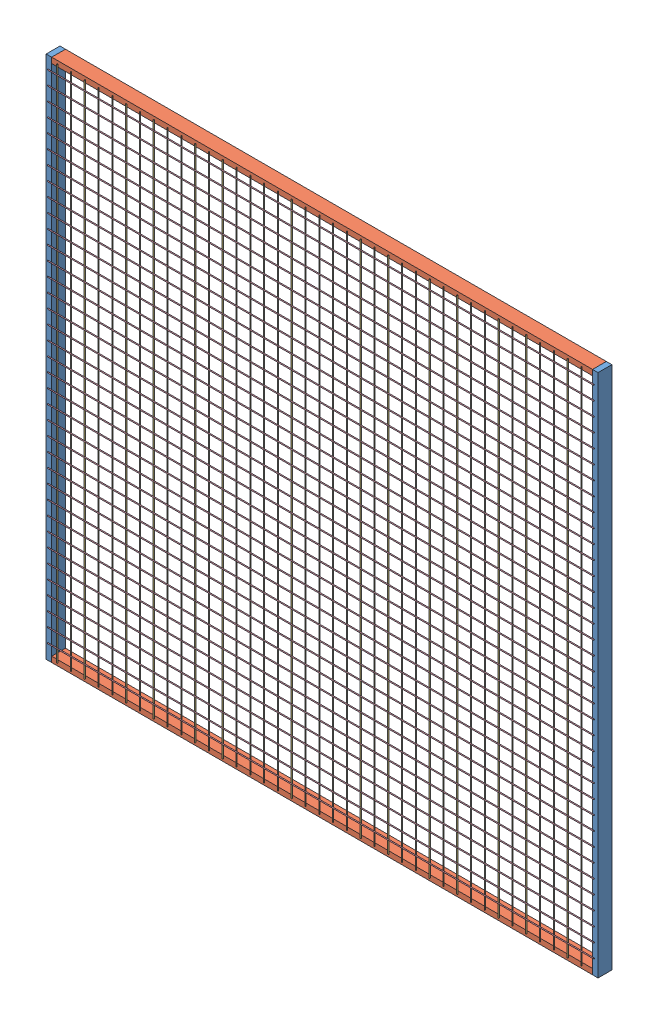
SolidWorks assembly 14E050 grille protection 1960x1900.SLDASM, configuration Défaut (file format 10000). Lengths in mm.
Overall size (2000 1900 56.43).
80 component instances, 4 part files, 16 mates.
Components (placement in the parent):
- 14E026 profilé grillage 1900x50x20-1: 14E026 profilé grillage 1900x50x20.SLDPRT [Défaut] at (-693.1899 -954.8799 25) size (20 1900 50)
- 14E026 profilé grillage 1900x50x20-2: 14E026 profilé grillage 1900x50x20.SLDPRT [Défaut] at (1286.8101 -954.8799 25) size (20 1900 50)
- 14E025 profilé grillage 1960x50x20-1: 14E025 profilé grillage 1960x50x20.SLDPRT [Défaut] at (1286.8101 925.1201 25) x (0 1 0) z (0 0 1) size (20 1960 50)
- 14E025 profilé grillage 1960x50x20-2: 14E025 profilé grillage 1960x50x20.SLDPRT [Défaut] at (1286.8101 -954.8799 25) x (0 1 0) z (0 0 1) size (20 1960 50)
- 14E031 fils vertical grille 1860 diam 3-147: 14E031 fils vertical grille 1860 diam 3.SLDPRT [Défaut] at (-651.6899 -944.8799 26.5) x (-0.245087 0 -0.969501) z (0.969501 0 -0.245087) size (3 1880 3)
- 14E031 fils vertical grille 1860 diam 3-148: 14E031 fils vertical grille 1860 diam 3.SLDPRT [Défaut] at (-601.6899 -944.8799 26.5) x (-0.245087 0 -0.969501) z (0.969501 0 -0.245087) size (3 1880 3)
- 14E031 fils vertical grille 1860 diam 3-149: 14E031 fils vertical grille 1860 diam 3.SLDPRT [Défaut] at (-551.6899 -944.8799 26.5) x (-0.245087 0 -0.969501) z (0.969501 0 -0.245087) size (3 1880 3)
- 14E031 fils vertical grille 1860 diam 3-150: 14E031 fils vertical grille 1860 diam 3.SLDPRT [Défaut] at (-501.6899 -944.8799 26.5) x (-0.245087 0 -0.969501) z (0.969501 0 -0.245087) size (3 1880 3)
- 14E031 fils vertical grille 1860 diam 3-151: 14E031 fils vertical grille 1860 diam 3.SLDPRT [Défaut] at (-451.6899 -944.8799 26.5) x (-0.245087 0 -0.969501) z (0.969501 0 -0.245087) size (3 1880 3)
- 14E031 fils vertical grille 1860 diam 3-152: 14E031 fils vertical grille 1860 diam 3.SLDPRT [Défaut] at (-401.6899 -944.8799 26.5) x (-0.245087 0 -0.969501) z (0.969501 0 -0.245087) size (3 1880 3)
- 14E031 fils vertical grille 1860 diam 3-153: 14E031 fils vertical grille 1860 diam 3.SLDPRT [Défaut] at (-351.6899 -944.8799 26.5) x (-0.245087 0 -0.969501) z (0.969501 0 -0.245087) size (3 1880 3)
- 14E031 fils vertical grille 1860 diam 3-154: 14E031 fils vertical grille 1860 diam 3.SLDPRT [Défaut] at (-301.6899 -944.8799 26.5) x (-0.245087 0 -0.969501) z (0.969501 0 -0.245087) size (3 1880 3)
- 14E031 fils vertical grille 1860 diam 3-155: 14E031 fils vertical grille 1860 diam 3.SLDPRT [Défaut] at (-251.6899 -944.8799 26.5) x (-0.245087 0 -0.969501) z (0.969501 0 -0.245087) size (3 1880 3)
- 14E031 fils vertical grille 1860 diam 3-156: 14E031 fils vertical grille 1860 diam 3.SLDPRT [Défaut] at (-201.6899 -944.8799 26.5) x (-0.245087 0 -0.969501) z (0.969501 0 -0.245087) size (3 1880 3)
- 14E031 fils vertical grille 1860 diam 3-157: 14E031 fils vertical grille 1860 diam 3.SLDPRT [Défaut] at (-151.6899 -944.8799 26.5) x (-0.245087 0 -0.969501) z (0.969501 0 -0.245087) size (3 1880 3)
- 14E031 fils vertical grille 1860 diam 3-158: 14E031 fils vertical grille 1860 diam 3.SLDPRT [Défaut] at (-101.6899 -944.8799 26.5) x (-0.245087 0 -0.969501) z (0.969501 0 -0.245087) size (3 1880 3)
- 14E031 fils vertical grille 1860 diam 3-159: 14E031 fils vertical grille 1860 diam 3.SLDPRT [Défaut] at (-51.6899 -944.8799 26.5) x (-0.245087 0 -0.969501) z (0.969501 0 -0.245087) size (3 1880 3)
- 14E031 fils vertical grille 1860 diam 3-160: 14E031 fils vertical grille 1860 diam 3.SLDPRT [Défaut] at (-1.6899 -944.8799 26.5) x (-0.245087 0 -0.969501) z (0.969501 0 -0.245087) size (3 1880 3)
- 14E031 fils vertical grille 1860 diam 3-161: 14E031 fils vertical grille 1860 diam 3.SLDPRT [Défaut] at (48.3101 -944.8799 26.5) x (-0.245087 0 -0.969501) z (0.969501 0 -0.245087) size (3 1880 3)
- 14E031 fils vertical grille 1860 diam 3-162: 14E031 fils vertical grille 1860 diam 3.SLDPRT [Défaut] at (98.3101 -944.8799 26.5) x (-0.245087 0 -0.969501) z (0.969501 0 -0.245087) size (3 1880 3)
- 14E031 fils vertical grille 1860 diam 3-163: 14E031 fils vertical grille 1860 diam 3.SLDPRT [Défaut] at (148.3101 -944.8799 26.5) x (-0.245087 0 -0.969501) z (0.969501 0 -0.245087) size (3 1880 3)
- 14E031 fils vertical grille 1860 diam 3-164: 14E031 fils vertical grille 1860 diam 3.SLDPRT [Défaut] at (198.3101 -944.8799 26.5) x (-0.245087 0 -0.969501) z (0.969501 0 -0.245087) size (3 1880 3)
- 14E031 fils vertical grille 1860 diam 3-165: 14E031 fils vertical grille 1860 diam 3.SLDPRT [Défaut] at (248.3101 -944.8799 26.5) x (-0.245087 0 -0.969501) z (0.969501 0 -0.245087) size (3 1880 3)
- 14E031 fils vertical grille 1860 diam 3-166: 14E031 fils vertical grille 1860 diam 3.SLDPRT [Défaut] at (298.3101 -944.8799 26.5) x (-0.245087 0 -0.969501) z (0.969501 0 -0.245087) size (3 1880 3)
- 14E031 fils vertical grille 1860 diam 3-167: 14E031 fils vertical grille 1860 diam 3.SLDPRT [Défaut] at (348.3101 -944.8799 26.5) x (-0.245087 0 -0.969501) z (0.969501 0 -0.245087) size (3 1880 3)
- 14E031 fils vertical grille 1860 diam 3-168: 14E031 fils vertical grille 1860 diam 3.SLDPRT [Défaut] at (398.3101 -944.8799 26.5) x (-0.245087 0 -0.969501) z (0.969501 0 -0.245087) size (3 1880 3)
- 14E031 fils vertical grille 1860 diam 3-169: 14E031 fils vertical grille 1860 diam 3.SLDPRT [Défaut] at (448.3101 -944.8799 26.5) x (-0.245087 0 -0.969501) z (0.969501 0 -0.245087) size (3 1880 3)
- 14E031 fils vertical grille 1860 diam 3-170: 14E031 fils vertical grille 1860 diam 3.SLDPRT [Défaut] at (498.3101 -944.8799 26.5) x (-0.245087 0 -0.969501) z (0.969501 0 -0.245087) size (3 1880 3)
- 14E031 fils vertical grille 1860 diam 3-171: 14E031 fils vertical grille 1860 diam 3.SLDPRT [Défaut] at (548.3101 -944.8799 26.5) x (-0.245087 0 -0.969501) z (0.969501 0 -0.245087) size (3 1880 3)
- 14E031 fils vertical grille 1860 diam 3-172: 14E031 fils vertical grille 1860 diam 3.SLDPRT [Défaut] at (598.3101 -944.8799 26.5) x (-0.245087 0 -0.969501) z (0.969501 0 -0.245087) size (3 1880 3)
- 14E031 fils vertical grille 1860 diam 3-173: 14E031 fils vertical grille 1860 diam 3.SLDPRT [Défaut] at (648.3101 -944.8799 26.5) x (-0.245087 0 -0.969501) z (0.969501 0 -0.245087) size (3 1880 3)
- 14E031 fils vertical grille 1860 diam 3-174: 14E031 fils vertical grille 1860 diam 3.SLDPRT [Défaut] at (698.3101 -944.8799 26.5) x (-0.245087 0 -0.969501) z (0.969501 0 -0.245087) size (3 1880 3)
- 14E031 fils vertical grille 1860 diam 3-175: 14E031 fils vertical grille 1860 diam 3.SLDPRT [Défaut] at (748.3101 -944.8799 26.5) x (-0.245087 0 -0.969501) z (0.969501 0 -0.245087) size (3 1880 3)
- 14E031 fils vertical grille 1860 diam 3-176: 14E031 fils vertical grille 1860 diam 3.SLDPRT [Défaut] at (798.3101 -944.8799 26.5) x (-0.245087 0 -0.969501) z (0.969501 0 -0.245087) size (3 1880 3)
- 14E031 fils vertical grille 1860 diam 3-177: 14E031 fils vertical grille 1860 diam 3.SLDPRT [Défaut] at (848.3101 -944.8799 26.5) x (-0.245087 0 -0.969501) z (0.969501 0 -0.245087) size (3 1880 3)
- 14E031 fils vertical grille 1860 diam 3-178: 14E031 fils vertical grille 1860 diam 3.SLDPRT [Défaut] at (898.3101 -944.8799 26.5) x (-0.245087 0 -0.969501) z (0.969501 0 -0.245087) size (3 1880 3)
- 14E031 fils vertical grille 1860 diam 3-179: 14E031 fils vertical grille 1860 diam 3.SLDPRT [Défaut] at (948.3101 -944.8799 26.5) x (-0.245087 0 -0.969501) z (0.969501 0 -0.245087) size (3 1880 3)
- 14E031 fils vertical grille 1860 diam 3-180: 14E031 fils vertical grille 1860 diam 3.SLDPRT [Défaut] at (998.3101 -944.8799 26.5) x (-0.245087 0 -0.969501) z (0.969501 0 -0.245087) size (3 1880 3)
- 14E031 fils vertical grille 1860 diam 3-181: 14E031 fils vertical grille 1860 diam 3.SLDPRT [Défaut] at (1048.3101 -944.8799 26.5) x (-0.245087 0 -0.969501) z (0.969501 0 -0.245087) size (3 1880 3)
- 14E031 fils vertical grille 1860 diam 3-182: 14E031 fils vertical grille 1860 diam 3.SLDPRT [Défaut] at (1098.3101 -944.8799 26.5) x (-0.245087 0 -0.969501) z (0.969501 0 -0.245087) size (3 1880 3)
- 14E031 fils vertical grille 1860 diam 3-183: 14E031 fils vertical grille 1860 diam 3.SLDPRT [Défaut] at (1148.3101 -944.8799 26.5) x (-0.245087 0 -0.969501) z (0.969501 0 -0.245087) size (3 1880 3)
- 14E031 fils vertical grille 1860 diam 3-184: 14E031 fils vertical grille 1860 diam 3.SLDPRT [Défaut] at (1198.3101 -944.8799 26.5) x (-0.245087 0 -0.969501) z (0.969501 0 -0.245087) size (3 1880 3)
- 14E031 fils vertical grille 1860 diam 3-185: 14E031 fils vertical grille 1860 diam 3.SLDPRT [Défaut] at (1248.3101 -944.8799 26.5) x (-0.245087 0 -0.969501) z (0.969501 0 -0.245087) size (3 1880 3)
- 14E031 fils vertical grille 1960 diam 3-76: 14E031 fils vertical grille 1960 diam 3.SLDPRT [Défaut] at (-683.1899 903.6201 29.5) x (0 0.937645 -0.347595) z (0 -0.347595 -0.937645) size (3 1980 3)
- 14E031 fils vertical grille 1960 diam 3-77: 14E031 fils vertical grille 1960 diam 3.SLDPRT [Défaut] at (-683.1899 853.6201 29.5) x (0 0.937645 -0.347595) z (0 -0.347595 -0.937645) size (3 1980 3)
- 14E031 fils vertical grille 1960 diam 3-78: 14E031 fils vertical grille 1960 diam 3.SLDPRT [Défaut] at (-683.1899 803.6201 29.5) x (0 0.937645 -0.347595) z (0 -0.347595 -0.937645) size (3 1980 3)
- 14E031 fils vertical grille 1960 diam 3-79: 14E031 fils vertical grille 1960 diam 3.SLDPRT [Défaut] at (-683.1899 753.6201 29.5) x (0 0.937645 -0.347595) z (0 -0.347595 -0.937645) size (3 1980 3)
- 14E031 fils vertical grille 1960 diam 3-80: 14E031 fils vertical grille 1960 diam 3.SLDPRT [Défaut] at (-683.1899 703.6201 29.5) x (0 0.937645 -0.347595) z (0 -0.347595 -0.937645) size (3 1980 3)
- 14E031 fils vertical grille 1960 diam 3-81: 14E031 fils vertical grille 1960 diam 3.SLDPRT [Défaut] at (-683.1899 653.6201 29.5) x (0 0.937645 -0.347595) z (0 -0.347595 -0.937645) size (3 1980 3)
- 14E031 fils vertical grille 1960 diam 3-82: 14E031 fils vertical grille 1960 diam 3.SLDPRT [Défaut] at (-683.1899 603.6201 29.5) x (0 0.937645 -0.347595) z (0 -0.347595 -0.937645) size (3 1980 3)
- 14E031 fils vertical grille 1960 diam 3-83: 14E031 fils vertical grille 1960 diam 3.SLDPRT [Défaut] at (-683.1899 553.6201 29.5) x (0 0.937645 -0.347595) z (0 -0.347595 -0.937645) size (3 1980 3)
- 14E031 fils vertical grille 1960 diam 3-84: 14E031 fils vertical grille 1960 diam 3.SLDPRT [Défaut] at (-683.1899 503.6201 29.5) x (0 0.937645 -0.347595) z (0 -0.347595 -0.937645) size (3 1980 3)
- 14E031 fils vertical grille 1960 diam 3-85: 14E031 fils vertical grille 1960 diam 3.SLDPRT [Défaut] at (-683.1899 453.6201 29.5) x (0 0.937645 -0.347595) z (0 -0.347595 -0.937645) size (3 1980 3)
- 14E031 fils vertical grille 1960 diam 3-86: 14E031 fils vertical grille 1960 diam 3.SLDPRT [Défaut] at (-683.1899 403.6201 29.5) x (0 0.937645 -0.347595) z (0 -0.347595 -0.937645) size (3 1980 3)
- 14E031 fils vertical grille 1960 diam 3-87: 14E031 fils vertical grille 1960 diam 3.SLDPRT [Défaut] at (-683.1899 353.6201 29.5) x (0 0.937645 -0.347595) z (0 -0.347595 -0.937645) size (3 1980 3)
- 14E031 fils vertical grille 1960 diam 3-88: 14E031 fils vertical grille 1960 diam 3.SLDPRT [Défaut] at (-683.1899 303.6201 29.5) x (0 0.937645 -0.347595) z (0 -0.347595 -0.937645) size (3 1980 3)
- 14E031 fils vertical grille 1960 diam 3-89: 14E031 fils vertical grille 1960 diam 3.SLDPRT [Défaut] at (-683.1899 253.6201 29.5) x (0 0.937645 -0.347595) z (0 -0.347595 -0.937645) size (3 1980 3)
- 14E031 fils vertical grille 1960 diam 3-90: 14E031 fils vertical grille 1960 diam 3.SLDPRT [Défaut] at (-683.1899 203.6201 29.5) x (0 0.937645 -0.347595) z (0 -0.347595 -0.937645) size (3 1980 3)
- 14E031 fils vertical grille 1960 diam 3-91: 14E031 fils vertical grille 1960 diam 3.SLDPRT [Défaut] at (-683.1899 153.6201 29.5) x (0 0.937645 -0.347595) z (0 -0.347595 -0.937645) size (3 1980 3)
- 14E031 fils vertical grille 1960 diam 3-92: 14E031 fils vertical grille 1960 diam 3.SLDPRT [Défaut] at (-683.1899 103.6201 29.5) x (0 0.937645 -0.347595) z (0 -0.347595 -0.937645) size (3 1980 3)
- 14E031 fils vertical grille 1960 diam 3-93: 14E031 fils vertical grille 1960 diam 3.SLDPRT [Défaut] at (-683.1899 53.6201 29.5) x (0 0.937645 -0.347595) z (0 -0.347595 -0.937645) size (3 1980 3)
- 14E031 fils vertical grille 1960 diam 3-94: 14E031 fils vertical grille 1960 diam 3.SLDPRT [Défaut] at (-683.1899 3.6201 29.5) x (0 0.937645 -0.347595) z (0 -0.347595 -0.937645) size (3 1980 3)
- 14E031 fils vertical grille 1960 diam 3-95: 14E031 fils vertical grille 1960 diam 3.SLDPRT [Défaut] at (-683.1899 -46.3799 29.5) x (0 0.937645 -0.347595) z (0 -0.347595 -0.937645) size (3 1980 3)
- 14E031 fils vertical grille 1960 diam 3-96: 14E031 fils vertical grille 1960 diam 3.SLDPRT [Défaut] at (-683.1899 -96.3799 29.5) x (0 0.937645 -0.347595) z (0 -0.347595 -0.937645) size (3 1980 3)
- 14E031 fils vertical grille 1960 diam 3-97: 14E031 fils vertical grille 1960 diam 3.SLDPRT [Défaut] at (-683.1899 -146.3799 29.5) x (0 0.937645 -0.347595) z (0 -0.347595 -0.937645) size (3 1980 3)
- 14E031 fils vertical grille 1960 diam 3-98: 14E031 fils vertical grille 1960 diam 3.SLDPRT [Défaut] at (-683.1899 -196.3799 29.5) x (0 0.937645 -0.347595) z (0 -0.347595 -0.937645) size (3 1980 3)
- 14E031 fils vertical grille 1960 diam 3-99: 14E031 fils vertical grille 1960 diam 3.SLDPRT [Défaut] at (-683.1899 -246.3799 29.5) x (0 0.937645 -0.347595) z (0 -0.347595 -0.937645) size (3 1980 3)
- 14E031 fils vertical grille 1960 diam 3-100: 14E031 fils vertical grille 1960 diam 3.SLDPRT [Défaut] at (-683.1899 -296.3799 29.5) x (0 0.937645 -0.347595) z (0 -0.347595 -0.937645) size (3 1980 3)
- 14E031 fils vertical grille 1960 diam 3-101: 14E031 fils vertical grille 1960 diam 3.SLDPRT [Défaut] at (-683.1899 -346.3799 29.5) x (0 0.937645 -0.347595) z (0 -0.347595 -0.937645) size (3 1980 3)
- 14E031 fils vertical grille 1960 diam 3-102: 14E031 fils vertical grille 1960 diam 3.SLDPRT [Défaut] at (-683.1899 -396.3799 29.5) x (0 0.937645 -0.347595) z (0 -0.347595 -0.937645) size (3 1980 3)
- 14E031 fils vertical grille 1960 diam 3-103: 14E031 fils vertical grille 1960 diam 3.SLDPRT [Défaut] at (-683.1899 -446.3799 29.5) x (0 0.937645 -0.347595) z (0 -0.347595 -0.937645) size (3 1980 3)
- 14E031 fils vertical grille 1960 diam 3-104: 14E031 fils vertical grille 1960 diam 3.SLDPRT [Défaut] at (-683.1899 -496.3799 29.5) x (0 0.937645 -0.347595) z (0 -0.347595 -0.937645) size (3 1980 3)
- 14E031 fils vertical grille 1960 diam 3-105: 14E031 fils vertical grille 1960 diam 3.SLDPRT [Défaut] at (-683.1899 -546.3799 29.5) x (0 0.937645 -0.347595) z (0 -0.347595 -0.937645) size (3 1980 3)
- 14E031 fils vertical grille 1960 diam 3-106: 14E031 fils vertical grille 1960 diam 3.SLDPRT [Défaut] at (-683.1899 -596.3799 29.5) x (0 0.937645 -0.347595) z (0 -0.347595 -0.937645) size (3 1980 3)
- 14E031 fils vertical grille 1960 diam 3-107: 14E031 fils vertical grille 1960 diam 3.SLDPRT [Défaut] at (-683.1899 -646.3799 29.5) x (0 0.937645 -0.347595) z (0 -0.347595 -0.937645) size (3 1980 3)
- 14E031 fils vertical grille 1960 diam 3-108: 14E031 fils vertical grille 1960 diam 3.SLDPRT [Défaut] at (-683.1899 -696.3799 29.5) x (0 0.937645 -0.347595) z (0 -0.347595 -0.937645) size (3 1980 3)
- 14E031 fils vertical grille 1960 diam 3-109: 14E031 fils vertical grille 1960 diam 3.SLDPRT [Défaut] at (-683.1899 -746.3799 29.5) x (0 0.937645 -0.347595) z (0 -0.347595 -0.937645) size (3 1980 3)
- 14E031 fils vertical grille 1960 diam 3-110: 14E031 fils vertical grille 1960 diam 3.SLDPRT [Défaut] at (-683.1899 -796.3799 29.5) x (0 0.937645 -0.347595) z (0 -0.347595 -0.937645) size (3 1980 3)
- 14E031 fils vertical grille 1960 diam 3-111: 14E031 fils vertical grille 1960 diam 3.SLDPRT [Défaut] at (-683.1899 -846.3799 29.5) x (0 0.937645 -0.347595) z (0 -0.347595 -0.937645) size (3 1980 3)
- 14E031 fils vertical grille 1960 diam 3-112: 14E031 fils vertical grille 1960 diam 3.SLDPRT [Défaut] at (-683.1899 -896.3799 29.5) x (0 0.937645 -0.347595) z (0 -0.347595 -0.937645) size (3 1980 3)
Mates (geometry in assembly coordinates):
- Coïncidente1: coincident anti-aligned: plane of 14E026 profilé grillage 1900x50x20-1 through (-673.1899 945.1201 25) normal (1 0 0); plane of 14E025 profilé grillage 1960x50x20-1 through (-673.1899 925.1201 -25) normal (-1 0 0)
- Coïncidente2: coincident aligned: plane of 14E026 profilé grillage 1900x50x20-1 through (-693.1899 945.1201 25) normal (0 0 1); plane of 14E025 profilé grillage 1960x50x20-1 through (-673.1899 925.1201 25) normal (0 0 1)
- Distance1: distance aligned: plane of 14E026 profilé grillage 1900x50x20-1 through (-693.1899 945.1201 -25) normal (0 1 0); plane of 14E025 profilé grillage 1960x50x20-1 through (-673.1899 945.1201 25) normal (0 1 0)
- Coïncidente4: coincident anti-aligned: plane of 14E026 profilé grillage 1900x50x20-2 through (1286.8101 945.1201 25) normal (-1 0 0); plane of 14E025 profilé grillage 1960x50x20-1 through (1286.8101 925.1201 -25) normal (1 0 0)
- Coïncidente5: coincident aligned: plane of 14E026 profilé grillage 1900x50x20-2 through (1286.8101 945.1201 25) normal (0 0 1); plane of 14E025 profilé grillage 1960x50x20-1 through (-673.1899 925.1201 25) normal (0 0 1)
- Distance2: distance aligned: plane of 14E025 profilé grillage 1960x50x20-1 through (-673.1899 945.1201 25) normal (0 1 0); plane of 14E026 profilé grillage 1900x50x20-2 through (1286.8101 945.1201 -25) normal (0 1 0)
- Coïncidente7: coincident anti-aligned: plane of 14E026 profilé grillage 1900x50x20-1 through (-673.1899 945.1201 25) normal (1 0 0); plane of 14E025 profilé grillage 1960x50x20-2 through (-673.1899 -954.8799 -25) normal (-1 0 0)
- Coïncidente9: coincident aligned: plane of 14E026 profilé grillage 1900x50x20-1 through (-693.1899 945.1201 25) normal (0 0 1); plane of 14E025 profilé grillage 1960x50x20-2 through (-673.1899 -954.8799 25) normal (0 0 1)
- Distance3: distance aligned: plane of 14E025 profilé grillage 1960x50x20-2 through (-673.1899 -954.8799 25) normal (0 -1 0); plane of 14E026 profilé grillage 1900x50x20-1 through (-693.1899 -954.8799 -25) normal (0 -1 0)
- Tangent1: tangent anti-aligned: plane of 14E025 profilé grillage 1960x50x20-1 through (-673.1899 925.1201 25) normal (0 0 1); cylinder of 14E031 fils vertical grille 1860 diam 3-147 through (-651.6899 935.1201 26.5) axis (0 -1 0) radius 1.5
- Distance4: distance = 40 mm aligned: plane of 14E026 profilé grillage 1900x50x20-1 through (-693.1899 945.1201 25) normal (-1 0 0); cylinder of 14E031 fils vertical grille 1860 diam 3-147 through (-651.6899 935.1201 26.5) axis (0 -1 0) radius 1.5
- Distance5: distance = 10 mm aligned: plane of 14E031 fils vertical grille 1860 diam 3-147 through (-651.6899 935.1201 26.5) normal (0 1 0); plane of 14E025 profilé grillage 1960x50x20-1 through (-673.1899 945.1201 25) normal (0 1 0)
- Parallèle3: parallel anti-aligned: line of 14E025 profilé grillage 1960x50x20-1 through (-673.1899 945.1201 25) axis (1 0 0); cylinder of 14E031 fils vertical grille 1960 diam 3-76 through (1296.8101 903.6201 29.5) axis (-1 0 0) radius 1.5
- Tangent7: tangent anti-aligned: cylinder of 14E031 fils vertical grille 1860 diam 3-147 through (-651.6899 935.1201 26.5) axis (0 -1 0) radius 1.5; cylinder of 14E031 fils vertical grille 1960 diam 3-76 through (1296.8101 903.6201 29.5) axis (-1 0 0) radius 1.5
- Distance13: distance = 20 mm anti-aligned: cylinder of 14E031 fils vertical grille 1960 diam 3-76 through (1296.8101 903.6201 29.5) axis (-1 0 0) radius 1.5; plane of 14E025 profilé grillage 1960x50x20-1 through (-673.1899 925.1201 25) normal (0 -1 0)
- Distance14: distance = 10 mm aligned: plane of 14E026 profilé grillage 1900x50x20-1 through (-693.1899 945.1201 25) normal (-1 0 0); plane of 14E031 fils vertical grille 1960 diam 3-76 through (-683.1899 903.6201 29.5) normal (-1 0 0)
